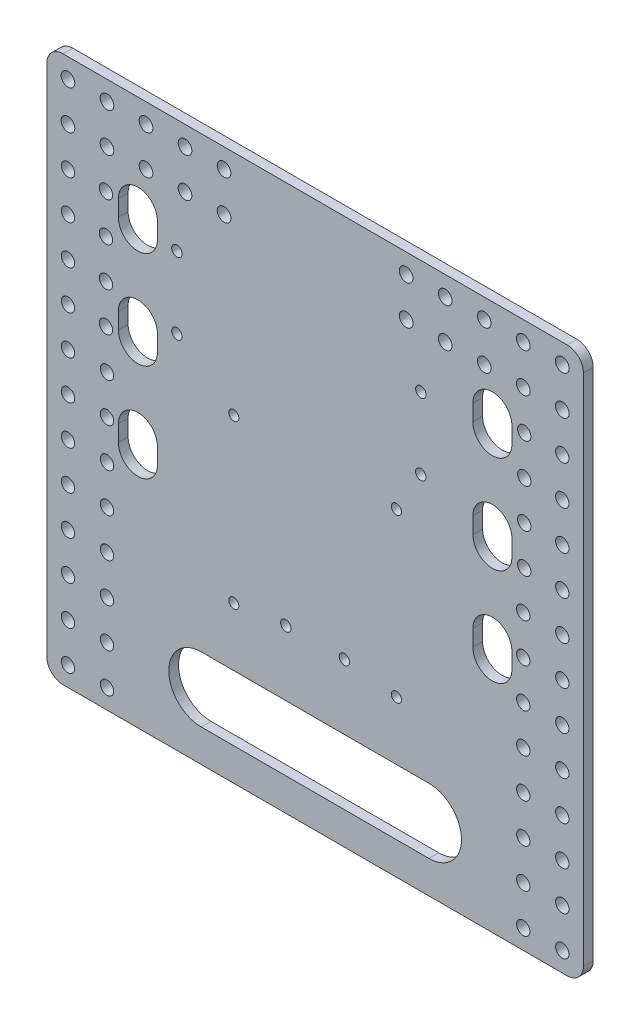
from build123d import *

# Parameters (mm, degrees)
SKETCH_1_W                = 165
SKETCH_1_H                = 430
SKETCH_1_R                = 2.05
EXTRUDE_1_DEPTH           = 3
CUT_EXTRUDE_1_DEPTH       = 231.304689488
CUT_EXTRUDE_1_DEPTH_BACK  = 231.304689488
SKETCH_2_R                = 1.6
SKETCH_6_W                = 77.5
SKETCH_6_H                = 180
EXTRUDE_2_DEPTH           = 3
FILLET_1_R                = 60
FILLET_2_R                = 20
FILLET_3_R                = 10
CUT_EXTRUDE_6_DEPTH       = 388.116261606
CUT_EXTRUDE_6_DEPTH_BACK  = 388.116261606
SKETCH_9_R                = 1.6
CUT_EXTRUDE_7_DEPTH       = 388.116261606
CUT_EXTRUDE_7_DEPTH_BACK  = 388.116261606
SKETCH_10_R               = 1.6
CUT_EXTRUDE_8_DEPTH       = 388.116261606
CUT_EXTRUDE_8_DEPTH_BACK  = 388.116261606
SKETCH_11_R               = 1.6
FILLET_4_R                = 30
CUT_EXTRUDE_10_DEPTH      = 388.116261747
CUT_EXTRUDE_10_DEPTH_BACK = 388.116261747
SKETCH_13_R               = 12.5
SKETCH_13_R_2             = 2.1
CUT_EXTRUDE_11_DEPTH      = 388.116261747
CUT_EXTRUDE_11_DEPTH_BACK = 388.116261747
SKETCH_16_R               = 1.55
CUT_EXTRUDE_13_DEPTH      = 10
SKETCH_17_R               = 1.55
SKETCH_17_R_2             = 2.05
CUT_EXTRUDE_14_DEPTH      = 10
CUT_EXTRUDE_15_DEPTH      = 10
FILLET_5_R                = 20
FILLET_6_R                = 70
SKETCH_19_R               = 1.35
CUT_EXTRUDE_17_DEPTH      = 64
SKETCH_20_W               = 150
SKETCH_20_H               = 100
CUT_EXTRUDE_18_DEPTH      = 64
SKETCH_21_R               = 2.05
CUT_EXTRUDE_19_DEPTH      = 10
SKETCH_22_R               = 2.05
CUT_EXTRUDE_20_DEPTH      = 10
SKETCH_23_R               = 2.05
EXTRUDE_3_DEPTH           = 3
SKETCH_24_W               = 584.80394318
SKETCH_24_H               = 468.32846902
CUT_EXTRUDE_21_DEPTH      = 10
CUT_EXTRUDE_22_DEPTH      = 10
SKETCH_27_W               = 500.039640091
SKETCH_27_H               = 286.272693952
SKETCH_27_W_2             = 165
SKETCH_27_H_2             = 168
CUT_EXTRUDE_24_DEPTH      = 10
SKETCH_28_R               = 2.1
CUT_EXTRUDE_25_DEPTH      = 10
SKETCH_31_R               = 2.05
CUT_EXTRUDE_28_DEPTH      = 10
CUT_EXTRUDE_29_DEPTH      = 10
FILLET_7_R                = 5


with BuildPart() as part:
    # Sketch 1 → Extrude 1 (new body)
    with BuildSketch(Plane.XY):
        Rectangle(SKETCH_1_W, SKETCH_1_H)
        with Locations((-70, 200)):
            Circle(SKETCH_1_R, mode=Mode.SUBTRACT)
        with Locations((-70, 185)):
            Circle(SKETCH_1_R, mode=Mode.SUBTRACT)
        with Locations(Location((70, 185, 0), (0, 0, 180))):
            Circle(SKETCH_1_R, mode=Mode.SUBTRACT)
        with Locations(Location((70, 200, 0), (0, 0, 180))):
            Circle(SKETCH_1_R, mode=Mode.SUBTRACT)
        with Locations(Location((-70, -185, 0), (0, 0, 180))):
            Circle(SKETCH_1_R, mode=Mode.SUBTRACT)
        with Locations(Location((-70, -200, 0), (0, 0, 180))):
            Circle(SKETCH_1_R, mode=Mode.SUBTRACT)
        with Locations((70, -200)):
            Circle(SKETCH_1_R, mode=Mode.SUBTRACT)
        with Locations((70, -185)):
            Circle(SKETCH_1_R, mode=Mode.SUBTRACT)
    extrude(amount=EXTRUDE_1_DEPTH)

    # Sketch 2 → Cut-Extrude 1 (cut, two sides: drawn at the far end of the back side and taken through both)
    with BuildSketch(Plane.XY.offset(3).offset(-CUT_EXTRUDE_1_DEPTH_BACK)):
        with Locations((-20.859650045, -20.859650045)):
            Circle(SKETCH_2_R)
        with Locations((-20.859650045, 20.859650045)):
            Circle(SKETCH_2_R)
        with Locations((20.859650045, 20.859650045)):
            Circle(SKETCH_2_R)
        with Locations((20.859650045, -20.859650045)):
            Circle(SKETCH_2_R)
    extrude(amount=CUT_EXTRUDE_1_DEPTH + CUT_EXTRUDE_1_DEPTH_BACK, mode=Mode.SUBTRACT)

    # Sketch 6 → Extrude 2 (add)
    with BuildSketch(Plane(origin=(0, 0, 0), x_dir=(-1, 0, 0), z_dir=(0, 0, -1))):
        Polygon((-82.5, 215), (82.5, 215), (82.5, 225), (200, 267), (200, 287), (-200, 287), (-200, 267), (-82.5, 225), align=None)
        with Locations((-121.25, 0)):
            Rectangle(SKETCH_6_W, SKETCH_6_H)
        with Locations((121.25, 0)):
            Rectangle(SKETCH_6_W, SKETCH_6_H)
        Polygon((82.5, -215), (82.5, -275), (225, -275), (225, -315), (-225, -315), (-225, -275), (-82.5, -275), (-82.5, -215), align=None)
    extrude(amount=-EXTRUDE_2_DEPTH)

    # Fillet 1
    fillet_1_edges = [part.edges().sort_by_distance(p)[0] for p in [
        (-82.5, -90, 1.5),
        (82.5, -90, 1.5),
    ]]
    fillet(fillet_1_edges, radius=FILLET_1_R)

    # Fillet 2
    fillet_2_edges = [part.edges().sort_by_distance(p)[0] for p in [
        (82.5, 225, 1.5),
        (-82.5, 225, 1.5),
    ]]
    fillet(fillet_2_edges, radius=FILLET_2_R)

    # Fillet 3
    fillet_3_edges = [part.edges().sort_by_distance(p)[0] for p in [
        (-225, -275, 1.5),
        (-225, -315, 1.5),
        (225, -315, 1.5),
        (225, -275, 1.5),
        (200, 267, 1.5),
        (200, 287, 1.5),
        (-200, 287, 1.5),
        (-200, 267, 1.5),
    ]]
    fillet(fillet_3_edges, radius=FILLET_3_R)

    # Sketch 9 → Cut-Extrude 6 (cut, two sides: drawn at the far end of the back side and taken through both)
    with BuildSketch(Plane(origin=(0, 0, 0), x_dir=(-1, 0, 0), z_dir=(0, 0, -1)).offset(-CUT_EXTRUDE_6_DEPTH_BACK)):
        with Locations((9, 169)):
            Circle(SKETCH_9_R)
        with Locations((-9, 169)):
            Circle(SKETCH_9_R)
        with Locations((-9, -169)):
            Circle(SKETCH_9_R)
        with Locations((9, -169)):
            Circle(SKETCH_9_R)
        with Locations((-119, 9)):
            Circle(SKETCH_9_R)
        with Locations((-119, -9)):
            Circle(SKETCH_9_R)
        with Locations((119, -9)):
            Circle(SKETCH_9_R)
        with Locations((119, 9)):
            Circle(SKETCH_9_R)
    extrude(amount=CUT_EXTRUDE_6_DEPTH + CUT_EXTRUDE_6_DEPTH_BACK, mode=Mode.SUBTRACT)

    # Sketch 10 → Cut-Extrude 7 (cut, two sides: drawn at the far end of the back side and taken through both)
    with BuildSketch(Plane(origin=(0, 0, 0), x_dir=(-1, 0, 0), z_dir=(0, 0, -1)).offset(-CUT_EXTRUDE_7_DEPTH_BACK)):
        with Locations((-32.5, 252)):
            Circle(SKETCH_10_R)
        with Locations((42.5, 252)):
            Circle(SKETCH_10_R)
        with Locations((-32.5, 230)):
            Circle(SKETCH_10_R)
        with Locations((42.5, 230)):
            Circle(SKETCH_10_R)
    extrude(amount=CUT_EXTRUDE_7_DEPTH + CUT_EXTRUDE_7_DEPTH_BACK, mode=Mode.SUBTRACT)

    # Sketch 11 → Cut-Extrude 8 (cut, two sides: drawn at the far end of the back side and taken through both)
    with BuildSketch(Plane(origin=(0, 0, 0), x_dir=(-1, 0, 0), z_dir=(0, 0, -1)).offset(-CUT_EXTRUDE_8_DEPTH_BACK)):
        with Locations((-67.5, 7.5)):
            Circle(SKETCH_11_R)
        with Locations((-52.5, 7.5)):
            Circle(SKETCH_11_R)
        with Locations((-52.5, -7.5)):
            Circle(SKETCH_11_R)
        with Locations((-67.5, -7.5)):
            Circle(SKETCH_11_R)
        with Locations((67.5, -7.5)):
            Circle(SKETCH_11_R)
        with Locations((52.5, -7.5)):
            Circle(SKETCH_11_R)
        with Locations((52.5, 7.5)):
            Circle(SKETCH_11_R)
        with Locations((67.5, 7.5)):
            Circle(SKETCH_11_R)
    extrude(amount=CUT_EXTRUDE_8_DEPTH + CUT_EXTRUDE_8_DEPTH_BACK, mode=Mode.SUBTRACT)

    # Fillet 4
    fillet_4_edges = [part.edges().sort_by_distance(p)[0] for p in [
        (160, -90, 1.5),
        (160, 90, 1.5),
        (-160, -90, 1.5),
        (-160, 90, 1.5),
    ]]
    fillet(fillet_4_edges, radius=FILLET_4_R)

    # Sketch 13 → Cut-Extrude 10 (cut, two sides: drawn at the far end of the back side and taken through both)
    with BuildSketch(Plane.XY.offset(3).offset(-CUT_EXTRUDE_10_DEPTH_BACK)):
        with Locations((0, 70)):
            Circle(SKETCH_13_R)
        with Locations((-20, 70)):
            Circle(SKETCH_13_R_2)
        with Locations(Location((20, 70, 0), (0, 0, 180))):
            Circle(SKETCH_13_R_2)
    extrude(amount=CUT_EXTRUDE_10_DEPTH + CUT_EXTRUDE_10_DEPTH_BACK, mode=Mode.SUBTRACT)

    # Sketch 14 → Cut-Extrude 11 (cut, two sides: drawn at the far end of the back side and taken through both)
    with BuildSketch(Plane.XY.offset(3).offset(-CUT_EXTRUDE_11_DEPTH_BACK)):
        with BuildLine():
            Line((105.5, 10), (105.5, -10))
            ThreePointArc((105.5, -10), (97.5, -18), (89.5, -10))
            Line((89.5, -10), (89.5, 10))
            ThreePointArc((89.5, 10), (97.5, 18), (105.5, 10))
        make_face()
        with BuildLine():
            Line((-105.5, 10), (-105.5, -10))
            ThreePointArc((-105.5, -10), (-97.5, -18), (-89.5, -10))
            Line((-89.5, -10), (-89.5, 10))
            ThreePointArc((-89.5, 10), (-97.5, 18), (-105.5, 10))
        make_face()
    extrude(amount=CUT_EXTRUDE_11_DEPTH + CUT_EXTRUDE_11_DEPTH_BACK, mode=Mode.SUBTRACT)

    # Sketch 16 → Cut-Extrude 13 (cut)
    with BuildSketch(Plane.XY.offset(3)):
        with Locations((-45, -75)):
            Circle(SKETCH_16_R)
        with Locations((45, -75)):
            Circle(SKETCH_16_R)
        with Locations((45, -175)):
            Circle(SKETCH_16_R)
        with Locations((-45, -175)):
            Circle(SKETCH_16_R)
    extrude(amount=-CUT_EXTRUDE_13_DEPTH, mode=Mode.SUBTRACT)

    # Sketch 17 → Cut-Extrude 14 (cut)
    with BuildSketch(Plane.XY.offset(3)):
        with Locations((-25, 217)):
            Circle(SKETCH_17_R)
        with Locations((25, 217)):
            Circle(SKETCH_17_R)
        with Locations((25, 167)):
            Circle(SKETCH_17_R)
        with Locations((-25, 167)):
            Circle(SKETCH_17_R)
        with Locations((-47.5, -255)):
            Circle(SKETCH_17_R_2)
        with Locations((47.5, -255)):
            Circle(SKETCH_17_R_2)
        with Locations((47.5, -230)):
            Circle(SKETCH_17_R_2)
        with Locations((-47.5, -230)):
            Circle(SKETCH_17_R_2)
        with Locations((-150, 47.063858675)):
            Circle(SKETCH_17_R_2)
        with Locations((-125, 47.063858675)):
            Circle(SKETCH_17_R_2)
        with Locations((-125, -47.936141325)):
            Circle(SKETCH_17_R_2)
        with Locations((-150, -47.936141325)):
            Circle(SKETCH_17_R_2)
        with Locations(Location((125, -47.936141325, 0), (0, 0, 180))):
            Circle(SKETCH_17_R_2)
        with Locations(Location((150, -47.936141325, 0), (0, 0, 180))):
            Circle(SKETCH_17_R_2)
        with Locations(Location((150, 47.063858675, 0), (0, 0, 180))):
            Circle(SKETCH_17_R_2)
        with Locations(Location((125, 47.063858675, 0), (0, 0, 180))):
            Circle(SKETCH_17_R_2)
        with Locations(Location((70, 175, 0), (0, 0, 180))):
            Circle(SKETCH_17_R_2)
        with Locations(Location((70, 160, 0), (0, 0, 180))):
            Circle(SKETCH_17_R_2)
        with Locations((-70, 160)):
            Circle(SKETCH_17_R_2)
        with Locations((-70, 175)):
            Circle(SKETCH_17_R_2)
    extrude(amount=-CUT_EXTRUDE_14_DEPTH, mode=Mode.SUBTRACT)

    # Sketch 18 → Cut-Extrude 15 (cut)
    with BuildSketch(Plane.XY.offset(3)):
        Polygon((-100, -315), (100, -315), (71.132486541, -265), (-71.132486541, -265), align=None)
    extrude(amount=-CUT_EXTRUDE_15_DEPTH, mode=Mode.SUBTRACT)

    # Fillet 5
    fillet_5_edges = [part.edges().sort_by_distance(p)[0] for p in [
        (100, -315, 1.5),
        (-100, -315, 1.5),
        (-71.132486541, -265, 1.5),
        (71.132486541, -265, 1.5),
    ]]
    fillet(fillet_5_edges, radius=FILLET_5_R)

    # Fillet 6
    fillet_6_edges = [part.edges().sort_by_distance(p)[0] for p in [
        (-82.5, -275, 1.5),
        (82.5, -275, 1.5),
    ]]
    fillet(fillet_6_edges, radius=FILLET_6_R)

    # Sketch 19 → Cut-Extrude 17 (cut)
    with BuildSketch(Plane.XY.offset(3)):
        with Locations((51.8, -12.8)):
            Circle(SKETCH_19_R)
        with Locations((-51.8, -12.8)):
            Circle(SKETCH_19_R)
        with Locations((-51.8, 90.8)):
            Circle(SKETCH_19_R)
        with Locations((51.8, 90.8)):
            Circle(SKETCH_19_R)
    extrude(amount=-CUT_EXTRUDE_17_DEPTH, mode=Mode.SUBTRACT)

    # Sketch 20 → Cut-Extrude 18 (cut)
    with BuildSketch(Plane(origin=(0, 0, 0), x_dir=(-1, 0, 0), z_dir=(0, 0, -1))):
        with Locations((0, -5)):
            Rectangle(SKETCH_20_W, SKETCH_20_H)
    extrude(amount=-CUT_EXTRUDE_18_DEPTH, mode=Mode.SUBTRACT)

    # Sketch 21 → Cut-Extrude 19 (cut)
    with BuildSketch(Plane(origin=(0, 0, 0), x_dir=(-1, 0, 0), z_dir=(0, 0, -1))):
        with Locations((-10, -196.5)):
            Circle(SKETCH_21_R)
        with Locations((10, -196.5)):
            Circle(SKETCH_21_R)
        with Locations((10, -208.5)):
            Circle(SKETCH_21_R)
        with Locations((-10, -208.5)):
            Circle(SKETCH_21_R)
    extrude(amount=-CUT_EXTRUDE_19_DEPTH, mode=Mode.SUBTRACT)

    # Sketch 22 → Cut-Extrude 20 (cut)
    with BuildSketch(Plane.XY.offset(3)):
        with Locations((-76, 209)):
            Circle(SKETCH_22_R)
        with Locations(Location((-64, 209, 0), (0, 0, 180))):
            Circle(SKETCH_22_R)
        with Locations(Location((76, 209, 0), (0, 0, 180))):
            Circle(SKETCH_22_R)
        with Locations((64, 209)):
            Circle(SKETCH_22_R)
        with Locations((-76, 197)):
            Circle(SKETCH_22_R)
        with Locations(Location((-64, 197, 0), (0, 0, 180))):
            Circle(SKETCH_22_R)
        with Locations((64, 197)):
            Circle(SKETCH_22_R)
        with Locations(Location((76, 197, 0), (0, 0, 180))):
            Circle(SKETCH_22_R)
        with Locations((-76, 185)):
            Circle(SKETCH_22_R)
        with Locations(Location((-64, 185, 0), (0, 0, 180))):
            Circle(SKETCH_22_R)
        with Locations((64, 185)):
            Circle(SKETCH_22_R)
        with Locations(Location((76, 185, 0), (0, 0, 180))):
            Circle(SKETCH_22_R)
        with Locations((-76, 173)):
            Circle(SKETCH_22_R)
        with Locations(Location((-64, 173, 0), (0, 0, 180))):
            Circle(SKETCH_22_R)
        with Locations((64, 173)):
            Circle(SKETCH_22_R)
        with Locations(Location((76, 173, 0), (0, 0, 180))):
            Circle(SKETCH_22_R)
        with Locations((-76, 161)):
            Circle(SKETCH_22_R)
        with Locations(Location((-64, 161, 0), (0, 0, 180))):
            Circle(SKETCH_22_R)
        with Locations((64, 161)):
            Circle(SKETCH_22_R)
        with Locations(Location((76, 161, 0), (0, 0, 180))):
            Circle(SKETCH_22_R)
        with Locations((-76, 149)):
            Circle(SKETCH_22_R)
        with Locations(Location((-64, 149, 0), (0, 0, 180))):
            Circle(SKETCH_22_R)
        with Locations((64, 149)):
            Circle(SKETCH_22_R)
        with Locations(Location((76, 149, 0), (0, 0, 180))):
            Circle(SKETCH_22_R)
        with Locations((-76, 137)):
            Circle(SKETCH_22_R)
        with Locations(Location((-64, 137, 0), (0, 0, 180))):
            Circle(SKETCH_22_R)
        with Locations((64, 137)):
            Circle(SKETCH_22_R)
        with Locations(Location((76, 137, 0), (0, 0, 180))):
            Circle(SKETCH_22_R)
        with Locations((-76, 125)):
            Circle(SKETCH_22_R)
        with Locations(Location((-64, 125, 0), (0, 0, 180))):
            Circle(SKETCH_22_R)
        with Locations((64, 125)):
            Circle(SKETCH_22_R)
        with Locations(Location((76, 125, 0), (0, 0, 180))):
            Circle(SKETCH_22_R)
    extrude(amount=-CUT_EXTRUDE_20_DEPTH, mode=Mode.SUBTRACT)

    # Sketch 23 → Extrude 3 (add)
    with BuildSketch(Plane.XY.offset(3)):
        with Locations((70, 200)):
            Circle(SKETCH_23_R)
        with Locations((70, 185)):
            Circle(SKETCH_23_R)
        with Locations((70, 175)):
            Circle(SKETCH_23_R)
        with Locations((70, 160)):
            Circle(SKETCH_23_R)
        with Locations((-70, 160)):
            Circle(SKETCH_23_R)
        with Locations((-70, 175)):
            Circle(SKETCH_23_R)
        with Locations((-70, 185)):
            Circle(SKETCH_23_R)
        with Locations((-70, 200)):
            Circle(SKETCH_23_R)
    extrude(amount=-EXTRUDE_3_DEPTH)

    # Sketch 24 → Cut-Extrude 21 (cut)
    with BuildSketch(Plane.XY.offset(3)):
        with Locations((-1.213286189, -115.16423451)):
            Rectangle(SKETCH_24_W, SKETCH_24_H)
    extrude(amount=-CUT_EXTRUDE_21_DEPTH, mode=Mode.SUBTRACT)

    # Sketch 25 → Cut-Extrude 22 (cut)
    with BuildSketch(Plane.XY.offset(3)):
        with BuildLine():
            Line((-35, 149), (35, 149))
            ThreePointArc((35, 149), (45, 139), (35, 129))
            Line((35, 129), (-35, 129))
            ThreePointArc((-35, 129), (-45, 139), (-35, 149))
        make_face()
    extrude(amount=-CUT_EXTRUDE_22_DEPTH, mode=Mode.SUBTRACT)

    # Sketch 27 → Cut-Extrude 24 (cut)
    with BuildSketch(Plane(origin=(0, 0, 0), x_dir=(-1, 0, 0), z_dir=(0, 0, -1))):
        with Locations((-21.668384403, 204.2500991)):
            Rectangle(SKETCH_27_W, SKETCH_27_H)
        with Locations((0, 203)):
            Rectangle(SKETCH_27_W_2, SKETCH_27_H_2, mode=Mode.SUBTRACT)
    extrude(amount=-CUT_EXTRUDE_24_DEPTH, mode=Mode.SUBTRACT)

    # Sketch 28 → Cut-Extrude 25 (cut)
    with BuildSketch(Plane(origin=(0, 0, 0), x_dir=(-1, 0, 0), z_dir=(0, 0, -1))):
        with Locations((-76, 281)):
            Circle(SKETCH_28_R)
        with Locations((-64, 281)):
            Circle(SKETCH_28_R)
        with Locations((-52, 281)):
            Circle(SKETCH_28_R)
        with Locations((-64, 269)):
            Circle(SKETCH_28_R)
        with Locations((-52, 269)):
            Circle(SKETCH_28_R)
        with Locations((-76, 269)):
            Circle(SKETCH_28_R)
        with Locations((-40, 281)):
            Circle(SKETCH_28_R)
        with Locations((-28, 281)):
            Circle(SKETCH_28_R)
        with Locations((-40, 269)):
            Circle(SKETCH_28_R)
        with Locations((28, 269)):
            Circle(SKETCH_28_R)
        with Locations((40, 269)):
            Circle(SKETCH_28_R)
        with Locations((28, 281)):
            Circle(SKETCH_28_R)
        with Locations((40, 281)):
            Circle(SKETCH_28_R)
        with Locations((76, 269)):
            Circle(SKETCH_28_R)
        with Locations((52, 269)):
            Circle(SKETCH_28_R)
        with Locations((64, 269)):
            Circle(SKETCH_28_R)
        with Locations((52, 281)):
            Circle(SKETCH_28_R)
        with Locations((64, 281)):
            Circle(SKETCH_28_R)
        with Locations((-28, 269)):
            Circle(SKETCH_28_R)
        with Locations((76, 281)):
            Circle(SKETCH_28_R)
    extrude(amount=-CUT_EXTRUDE_25_DEPTH, mode=Mode.SUBTRACT)

    # Sketch 31 → Cut-Extrude 28 (cut)
    with BuildSketch(Plane.XY.offset(3)):
        with Locations((-76, 221)):
            Circle(SKETCH_31_R)
        with Locations((-64.303930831, 220.996150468)):
            Circle(SKETCH_31_R)
        with Locations((-76, 233)):
            Circle(SKETCH_31_R)
        with Locations((-64.303930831, 232.996150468)):
            Circle(SKETCH_31_R)
        with Locations((-76, 245)):
            Circle(SKETCH_31_R)
        with Locations((-64.303930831, 244.996150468)):
            Circle(SKETCH_31_R)
        with Locations((-76, 257)):
            Circle(SKETCH_31_R)
        with Locations((-64.303930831, 256.996150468)):
            Circle(SKETCH_31_R)
        with Locations(Location((64.303930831, 256.996150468, 0), (0, 0, 180))):
            Circle(SKETCH_31_R)
        with Locations(Location((76, 257, 0), (0, 0, 180))):
            Circle(SKETCH_31_R)
        with Locations(Location((64.303930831, 244.996150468, 0), (0, 0, 180))):
            Circle(SKETCH_31_R)
        with Locations(Location((76, 245, 0), (0, 0, 180))):
            Circle(SKETCH_31_R)
        with Locations(Location((64.303930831, 232.996150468, 0), (0, 0, 180))):
            Circle(SKETCH_31_R)
        with Locations(Location((76, 233, 0), (0, 0, 180))):
            Circle(SKETCH_31_R)
        with Locations(Location((64.303930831, 220.996150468, 0), (0, 0, 180))):
            Circle(SKETCH_31_R)
        with Locations(Location((76, 221, 0), (0, 0, 180))):
            Circle(SKETCH_31_R)
    extrude(amount=-CUT_EXTRUDE_28_DEPTH, mode=Mode.SUBTRACT)

    # Sketch 32 → Cut-Extrude 29 (cut)
    with BuildSketch(Plane(origin=(0, 0, 0), x_dir=(-1, 0, 0), z_dir=(0, 0, -1))):
        with BuildLine():
            Line((-48.5, 257), (-48.5, 252))
            ThreePointArc((-48.5, 252), (-54.5, 246), (-60.5, 252))
            Line((-60.5, 252), (-60.5, 257))
            ThreePointArc((-60.5, 257), (-54.5, 263), (-48.5, 257))
        make_face()
        with BuildLine():
            Line((48.5, 257), (48.5, 252))
            ThreePointArc((48.5, 252), (54.5, 246), (60.5, 252))
            Line((60.5, 252), (60.5, 257))
            ThreePointArc((60.5, 257), (54.5, 263), (48.5, 257))
        make_face()
        with BuildLine():
            Line((-48.5, 227), (-48.5, 222))
            ThreePointArc((-48.5, 222), (-54.5, 216), (-60.5, 222))
            Line((-60.5, 222), (-60.5, 227))
            ThreePointArc((-60.5, 227), (-54.5, 233), (-48.5, 227))
        make_face()
        with BuildLine():
            Line((48.5, 227), (48.5, 222))
            ThreePointArc((48.5, 222), (54.5, 216), (60.5, 222))
            Line((60.5, 222), (60.5, 227))
            ThreePointArc((60.5, 227), (54.5, 233), (48.5, 227))
        make_face()
        with BuildLine():
            Line((-48.5, 197), (-48.5, 192))
            ThreePointArc((-48.5, 192), (-54.5, 186), (-60.5, 192))
            Line((-60.5, 192), (-60.5, 197))
            ThreePointArc((-60.5, 197), (-54.5, 203), (-48.5, 197))
        make_face()
        with BuildLine():
            Line((48.5, 197), (48.5, 192))
            ThreePointArc((48.5, 192), (54.5, 186), (60.5, 192))
            Line((60.5, 192), (60.5, 197))
            ThreePointArc((60.5, 197), (54.5, 203), (48.5, 197))
        make_face()
    extrude(amount=-CUT_EXTRUDE_29_DEPTH, mode=Mode.SUBTRACT)

    # Fillet 7
    fillet_7_edges = [part.edges().sort_by_distance(p)[0] for p in [
        (-82.5, 287, 1.5),
        (82.5, 287, 1.5),
        (-82.5, 119, 1.5),
        (82.5, 119, 1.5),
    ]]
    fillet(fillet_7_edges, radius=FILLET_7_R)


solid = part.part
